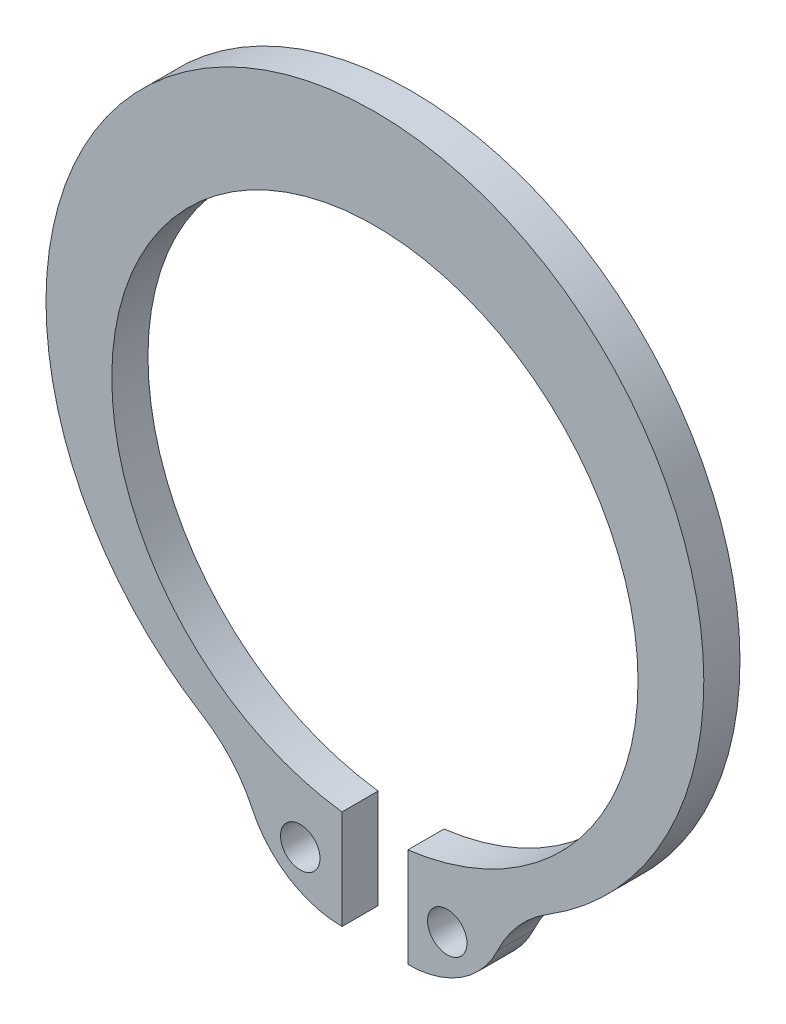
from build123d import *

# Parameters (mm, degrees)
ESQUISSE1_R          = 0.6
BASE_EXTRUSION_DEPTH = 1.1


with BuildPart() as part:
    # Esquisse1 → Base-Extrusion (new body)
    with BuildSketch(Plane.XY):
        with BuildLine():
            Line((-1, -7.937253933), (-1, -10.95445115))
            ThreePointArc((-1, -10.95445115), (-2.619290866, -10.48310863), (-3.732654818, -9.216346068))
            ThreePointArc((-3.732654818, -9.216346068), (-4.368615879, -8.251450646), (-5.253876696, -7.508629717))
            ThreePointArc((-5.253876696, -7.508629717), (0, 11), (5.253876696, -7.508629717))
            ThreePointArc((5.253876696, -7.508629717), (4.368615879, -8.251450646), (3.732654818, -9.216346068))
            ThreePointArc((3.732654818, -9.216346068), (2.619290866, -10.48310863), (1, -10.95445115))
            Line((1, -10.95445115), (1, -7.937253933))
            ThreePointArc((1, -7.937253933), (0, 8), (-1, -7.937253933))
        make_face()
        with Locations((2.2, -9.5)):
            Circle(ESQUISSE1_R, mode=Mode.SUBTRACT)
        with Locations((-2.27, -9.5)):
            Circle(ESQUISSE1_R, mode=Mode.SUBTRACT)
    extrude(amount=BASE_EXTRUSION_DEPTH)


solid = part.part
